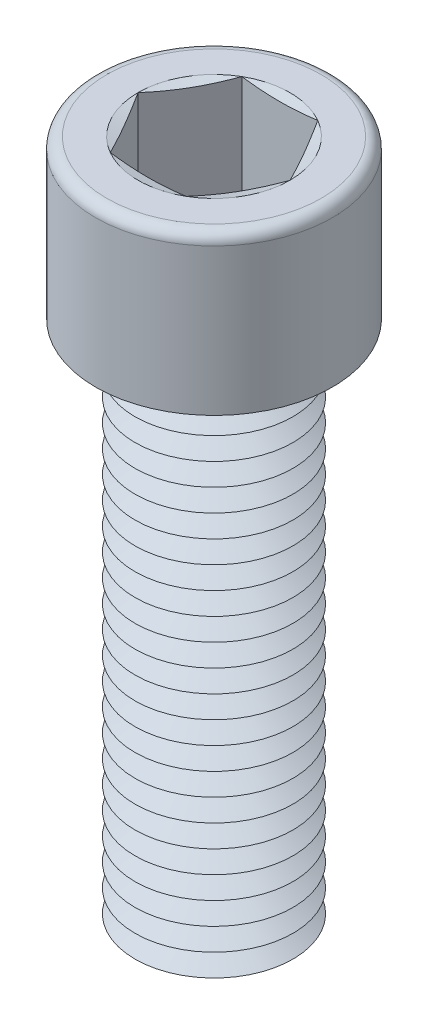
from build123d import *

# Parameters (mm, degrees)
SKETCH1_R       = 6
EXTRUDE1_DEPTH  = 40
SKETCH2_R       = 9
EXTRUDE2_DEPTH  = 12
EXTRUDE3_DEPTH  = 10
FILLET1_R       = 0.85
LPATTERN1_COUNT = 24
LPATTERN1_PITCH = 1.7


with BuildPart() as part:
    # Sketch1 → Extrude1 (new body)
    with BuildSketch(Plane(origin=(0, 0, 0), x_dir=(1, 0, 0), z_dir=(0, 1, 0))):
        with Locations(Location((0, 0, 0), (0, 0, 270))):
            Circle(SKETCH1_R)
    extrude(amount=EXTRUDE1_DEPTH)

    # Sketch2 → Extrude2 (add)
    with BuildSketch(Plane(origin=(0, 40, 0), x_dir=(1, 0, 0), z_dir=(0, 1, 0))):
        with Locations(Location((0, 0, 0), (0, 0, 270))):
            Circle(SKETCH2_R)
    extrude(amount=EXTRUDE2_DEPTH)

    # Sketch3 → Extrude3 (cut)
    with BuildSketch(Plane(origin=(0, 52, 0), x_dir=(1, 0, 0), z_dir=(0, 1, 0))):
        Polygon((2.886751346, 5), (-2.886751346, 5), (-5.773502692, 0), (-2.886751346, -5), (2.886751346, -5), (5.773502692, 0), align=None)
    extrude(amount=-EXTRUDE3_DEPTH, mode=Mode.SUBTRACT)

    # Fillet1
    fillet1_edges = [part.edges().sort_by_distance(p)[0] for p in [
        (0, 52, -9),
    ]]
    fillet(fillet1_edges, radius=FILLET1_R)

    # Sketch4 → Cut-Revolve1 (revolve, cut)
    with BuildSketch(Plane(origin=(0, 0, 0), x_dir=(0, 0, -1), z_dir=(1, 0, 0))):
        Polygon((-5, 42), (0, 42), (0, 39.113248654), align=None)
    revolve(axis=Axis((0, 42, 0), (0, -1, 0)), mode=Mode.SUBTRACT)

    # Sketch5 → Cut-Revolve2 (revolve, cut)
    with BuildSketch(Plane.XY, mode=Mode.PRIVATE) as cut_revolve2_sk:
        Polygon((-6, 0.85), (-6, -0.85), (-4.527756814, 0), align=None)
    cut_revolve2 = revolve(cut_revolve2_sk.sketch.rotate(Axis((0, 40, 0), (0, -1, 0)), 270), axis=Axis((0, 40, 0), (0, -1, 0)), mode=Mode.SUBTRACT)

    # LPattern1: Cut-Revolve2 ×24
    with Locations(*[(0, i * LPATTERN1_PITCH, 0) for i in range(1, LPATTERN1_COUNT)]):
        add(cut_revolve2, mode=Mode.SUBTRACT)

    # Extrude4 cone 1 section (on through the dimple's axis) → Extrude4 (revolve, cut)
    with BuildSketch(Plane(origin=(0, 52, 0), x_dir=(0, 0, 1), z_dir=(1, 0, 0))):
        Polygon((0, 0), (5.773502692, 0), (0, 1.547005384), align=None)
    revolve(axis=Axis((0, 52, 0), (0, -1, 0)), mode=Mode.SUBTRACT)


solid = part.part
